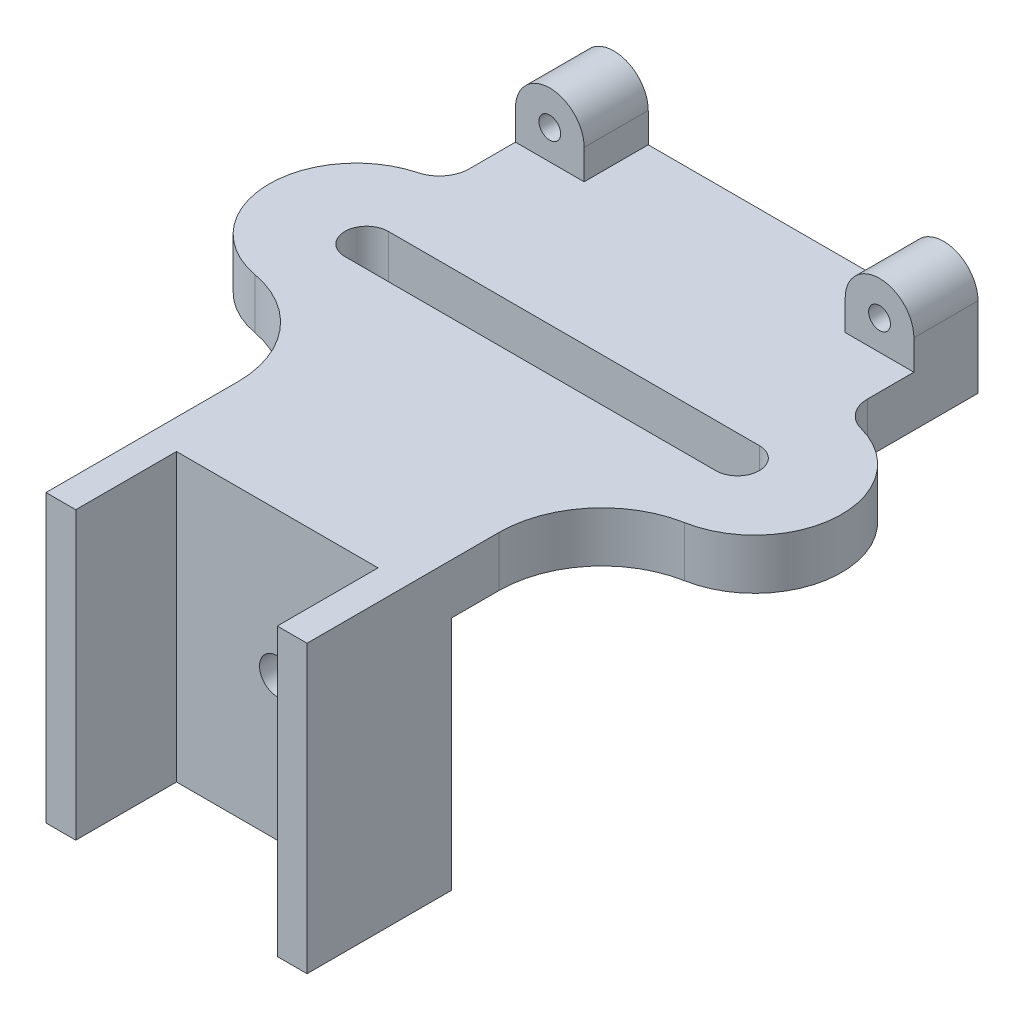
ISO-10303-21;
HEADER;
FILE_DESCRIPTION(('STEP AP214'),'2;1');
FILE_NAME('part.step','',(''),(''),'','','');
FILE_SCHEMA(('AUTOMOTIVE_DESIGN { 1 0 10303 214 1 1 1 1 }'));
ENDSEC;
DATA;
#1=APPLICATION_CONTEXT('core data for automotive mechanical design processes');
#2=APPLICATION_PROTOCOL_DEFINITION('international standard','automotive_design',2000,#1);
#3=PRODUCT_CONTEXT('',#1,'mechanical');
#4=PRODUCT('Part','Part','',(#3));
#5=PRODUCT_RELATED_PRODUCT_CATEGORY('part','',(#4));
#6=PRODUCT_DEFINITION_FORMATION('','',#4);
#7=PRODUCT_DEFINITION_CONTEXT('part definition',#1,'design');
#8=PRODUCT_DEFINITION('design','',#6,#7);
#9=PRODUCT_DEFINITION_SHAPE('','',#8);
#10=(LENGTH_UNIT() NAMED_UNIT(*) SI_UNIT(.MILLI.,.METRE.));
#11=(NAMED_UNIT(*) PLANE_ANGLE_UNIT() SI_UNIT($,.RADIAN.));
#12=(NAMED_UNIT(*) SI_UNIT($,.STERADIAN.) SOLID_ANGLE_UNIT());
#13=UNCERTAINTY_MEASURE_WITH_UNIT(LENGTH_MEASURE(1.E-05),#10,'distance_accuracy_value','');
#14=(GEOMETRIC_REPRESENTATION_CONTEXT(3) GLOBAL_UNCERTAINTY_ASSIGNED_CONTEXT((#13)) GLOBAL_UNIT_ASSIGNED_CONTEXT((#10,
#11,#12)) REPRESENTATION_CONTEXT('',''));
#15=CARTESIAN_POINT('',(0.,0.,0.));
#16=DIRECTION('',(0.,0.,1.));
#17=DIRECTION('',(1.,0.,0.));
#18=AXIS2_PLACEMENT_3D('',#15,#16,#17);
#19=CARTESIAN_POINT('',(50.8,11.176,24.5062056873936));
#20=DIRECTION('',(0.,-1.,0.));
#21=DIRECTION('',(0.,0.,-1.));
#22=AXIS2_PLACEMENT_3D('',#19,#20,#21);
#23=PLANE('',#22);
#24=CARTESIAN_POINT('',(41.148,11.176,50.292));
#25=DIRECTION('',(0.,1.,0.));
#26=DIRECTION('',(0.,0.,-1.));
#27=AXIS2_PLACEMENT_3D('',#24,#25,#26);
#28=CIRCLE('',#27,4.826);
#29=CARTESIAN_POINT('',(41.148,11.176,55.118));
#30=VERTEX_POINT('',#29);
#31=CARTESIAN_POINT('',(41.148,11.176,45.466));
#32=VERTEX_POINT('',#31);
#33=EDGE_CURVE('E360',#30,#32,#28,.T.);
#34=ORIENTED_EDGE('',*,*,#33,.F.);
#35=DIRECTION('',(1.,0.,0.));
#36=VECTOR('',#35,1.);
#37=CARTESIAN_POINT('',(0.,11.176,55.118));
#38=LINE('',#37,#36);
#39=CARTESIAN_POINT('',(-41.148,11.176,55.118));
#40=VERTEX_POINT('',#39);
#41=EDGE_CURVE('E368',#40,#30,#38,.T.);
#42=ORIENTED_EDGE('',*,*,#41,.F.);
#43=CARTESIAN_POINT('',(-41.148,11.176,50.292));
#44=DIRECTION('',(0.,1.,0.));
#45=DIRECTION('',(0.,0.,1.));
#46=AXIS2_PLACEMENT_3D('',#43,#44,#45);
#47=CIRCLE('',#46,4.826);
#48=CARTESIAN_POINT('',(-41.148,11.176,45.466));
#49=VERTEX_POINT('',#48);
#50=EDGE_CURVE('E365',#49,#40,#47,.T.);
#51=ORIENTED_EDGE('',*,*,#50,.F.);
#52=DIRECTION('',(-1.,0.,0.));
#53=VECTOR('',#52,1.);
#54=CARTESIAN_POINT('',(0.,11.176,45.466));
#55=LINE('',#54,#53);
#56=EDGE_CURVE('E362',#32,#49,#55,.T.);
#57=ORIENTED_EDGE('',*,*,#56,.F.);
#58=EDGE_LOOP('',(#34,#42,#51,#57));
#59=FACE_BOUND('',#58,.T.);
#60=DIRECTION('',(1.,0.,0.));
#61=VECTOR('',#60,1.);
#62=CARTESIAN_POINT('',(-44.196,11.176,14.224));
#63=LINE('',#62,#61);
#64=CARTESIAN_POINT('',(-44.196,11.176,14.224));
#65=VERTEX_POINT('',#64);
#66=CARTESIAN_POINT('',(-28.956,11.176,14.224));
#67=VERTEX_POINT('',#66);
#68=EDGE_CURVE('E317',#65,#67,#63,.T.);
#69=ORIENTED_EDGE('',*,*,#68,.F.);
#70=DIRECTION('',(0.,0.,1.));
#71=VECTOR('',#70,1.);
#72=CARTESIAN_POINT('',(-44.196,11.176,0.));
#73=LINE('',#72,#71);
#74=CARTESIAN_POINT('',(-44.196,11.176,24.5062056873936));
#75=VERTEX_POINT('',#74);
#76=EDGE_CURVE('E398',#65,#75,#73,.T.);
#77=ORIENTED_EDGE('',*,*,#76,.T.);
#78=CARTESIAN_POINT('',(-50.8,11.176,24.5062056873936));
#79=DIRECTION('',(0.,-1.,0.));
#80=DIRECTION('',(0.,0.,1.));
#81=AXIS2_PLACEMENT_3D('',#78,#79,#80);
#82=CIRCLE('',#81,6.604);
#83=CARTESIAN_POINT('',(-49.1166274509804,11.176,30.8920551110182));
#84=VERTEX_POINT('',#83);
#85=EDGE_CURVE('E400',#75,#84,#82,.T.);
#86=ORIENTED_EDGE('',*,*,#85,.T.);
#87=CARTESIAN_POINT('',(-44.196,11.176,49.5583841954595));
#88=DIRECTION('',(0.,1.,0.));
#89=DIRECTION('',(0.,0.,1.));
#90=AXIS2_PLACEMENT_3D('',#87,#88,#89);
#91=CIRCLE('',#90,19.304);
#92=CARTESIAN_POINT('',(-47.6846746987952,11.176,68.5445255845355));
#93=VERTEX_POINT('',#92);
#94=EDGE_CURVE('E402',#84,#93,#91,.T.);
#95=ORIENTED_EDGE('',*,*,#94,.T.);
#96=CARTESIAN_POINT('',(-51.816,11.176,91.0281140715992));
#97=DIRECTION('',(0.,-1.,0.));
#98=DIRECTION('',(0.,0.,-1.));
#99=AXIS2_PLACEMENT_3D('',#96,#97,#98);
#100=CIRCLE('',#99,22.86);
#101=CARTESIAN_POINT('',(-28.956,11.176,91.0281140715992));
#102=VERTEX_POINT('',#101);
#103=EDGE_CURVE('E404',#93,#102,#100,.T.);
#104=ORIENTED_EDGE('',*,*,#103,.T.);
#105=DIRECTION('',(0.,0.,1.));
#106=VECTOR('',#105,1.);
#107=CARTESIAN_POINT('',(-28.956,11.176,133.604));
#108=LINE('',#107,#106);
#109=CARTESIAN_POINT('',(-28.956,11.176,133.604));
#110=VERTEX_POINT('',#109);
#111=EDGE_CURVE('E406',#102,#110,#108,.T.);
#112=ORIENTED_EDGE('',*,*,#111,.T.);
#113=DIRECTION('',(1.,0.,0.));
#114=VECTOR('',#113,1.);
#115=CARTESIAN_POINT('',(-22.352,11.176,133.604));
#116=LINE('',#115,#114);
#117=CARTESIAN_POINT('',(-22.352,11.176,133.604));
#118=VERTEX_POINT('',#117);
#119=EDGE_CURVE('E408',#110,#118,#116,.T.);
#120=ORIENTED_EDGE('',*,*,#119,.T.);
#121=DIRECTION('',(0.,0.,-1.));
#122=VECTOR('',#121,1.);
#123=CARTESIAN_POINT('',(-22.352,11.176,111.252));
#124=LINE('',#123,#122);
#125=CARTESIAN_POINT('',(-22.352,11.176,111.252));
#126=VERTEX_POINT('',#125);
#127=EDGE_CURVE('E410',#118,#126,#124,.T.);
#128=ORIENTED_EDGE('',*,*,#127,.T.);
#129=DIRECTION('',(1.,0.,0.));
#130=VECTOR('',#129,1.);
#131=CARTESIAN_POINT('',(-22.352,11.176,111.252));
#132=LINE('',#131,#130);
#133=CARTESIAN_POINT('',(22.352,11.176,111.252));
#134=VERTEX_POINT('',#133);
#135=EDGE_CURVE('E412',#126,#134,#132,.T.);
#136=ORIENTED_EDGE('',*,*,#135,.T.);
#137=DIRECTION('',(0.,0.,1.));
#138=VECTOR('',#137,1.);
#139=CARTESIAN_POINT('',(22.352,11.176,111.252));
#140=LINE('',#139,#138);
#141=CARTESIAN_POINT('',(22.352,11.176,133.604));
#142=VERTEX_POINT('',#141);
#143=EDGE_CURVE('E258',#134,#142,#140,.T.);
#144=ORIENTED_EDGE('',*,*,#143,.T.);
#145=DIRECTION('',(1.,0.,0.));
#146=VECTOR('',#145,1.);
#147=CARTESIAN_POINT('',(22.352,11.176,133.604));
#148=LINE('',#147,#146);
#149=CARTESIAN_POINT('',(28.956,11.176,133.604));
#150=VERTEX_POINT('',#149);
#151=EDGE_CURVE('E415',#142,#150,#148,.T.);
#152=ORIENTED_EDGE('',*,*,#151,.T.);
#153=DIRECTION('',(0.,0.,-1.));
#154=VECTOR('',#153,1.);
#155=CARTESIAN_POINT('',(28.956,11.176,133.604));
#156=LINE('',#155,#154);
#157=CARTESIAN_POINT('',(28.956,11.176,91.0281140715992));
#158=VERTEX_POINT('',#157);
#159=EDGE_CURVE('E417',#150,#158,#156,.T.);
#160=ORIENTED_EDGE('',*,*,#159,.T.);
#161=CARTESIAN_POINT('',(51.816,11.176,91.0281140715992));
#162=DIRECTION('',(0.,-1.,0.));
#163=DIRECTION('',(0.,0.,1.));
#164=AXIS2_PLACEMENT_3D('',#161,#162,#163);
#165=CIRCLE('',#164,22.86);
#166=CARTESIAN_POINT('',(47.6846746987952,11.176,68.5445255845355));
#167=VERTEX_POINT('',#166);
#168=EDGE_CURVE('E419',#158,#167,#165,.T.);
#169=ORIENTED_EDGE('',*,*,#168,.T.);
#170=CARTESIAN_POINT('',(44.196,11.176,49.5583841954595));
#171=DIRECTION('',(0.,1.,0.));
#172=DIRECTION('',(0.,0.,-1.));
#173=AXIS2_PLACEMENT_3D('',#170,#171,#172);
#174=CIRCLE('',#173,19.304);
#175=CARTESIAN_POINT('',(49.1166274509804,11.176,30.8920551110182));
#176=VERTEX_POINT('',#175);
#177=EDGE_CURVE('E421',#167,#176,#174,.T.);
#178=ORIENTED_EDGE('',*,*,#177,.T.);
#179=CARTESIAN_POINT('',(50.8,11.176,24.5062056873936));
#180=DIRECTION('',(0.,-1.,0.));
#181=DIRECTION('',(0.,0.,-1.));
#182=AXIS2_PLACEMENT_3D('',#179,#180,#181);
#183=CIRCLE('',#182,6.604);
#184=CARTESIAN_POINT('',(44.196,11.176,24.5062056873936));
#185=VERTEX_POINT('',#184);
#186=EDGE_CURVE('E423',#176,#185,#183,.T.);
#187=ORIENTED_EDGE('',*,*,#186,.T.);
#188=DIRECTION('',(0.,0.,-1.));
#189=VECTOR('',#188,1.);
#190=CARTESIAN_POINT('',(44.196,11.176,0.));
#191=LINE('',#190,#189);
#192=CARTESIAN_POINT('',(44.196,11.176,14.224));
#193=VERTEX_POINT('',#192);
#194=EDGE_CURVE('E392',#185,#193,#191,.T.);
#195=ORIENTED_EDGE('',*,*,#194,.T.);
#196=DIRECTION('',(-1.,0.,0.));
#197=VECTOR('',#196,1.);
#198=CARTESIAN_POINT('',(44.196,11.176,14.224));
#199=LINE('',#198,#197);
#200=CARTESIAN_POINT('',(28.956,11.176,14.224));
#201=VERTEX_POINT('',#200);
#202=EDGE_CURVE('E335',#193,#201,#199,.T.);
#203=ORIENTED_EDGE('',*,*,#202,.T.);
#204=DIRECTION('',(0.,0.,-1.));
#205=VECTOR('',#204,1.);
#206=CARTESIAN_POINT('',(28.956,11.176,14.224));
#207=LINE('',#206,#205);
#208=CARTESIAN_POINT('',(28.956,11.176,0.));
#209=VERTEX_POINT('',#208);
#210=EDGE_CURVE('E347',#201,#209,#207,.T.);
#211=ORIENTED_EDGE('',*,*,#210,.T.);
#212=DIRECTION('',(-1.,0.,0.));
#213=VECTOR('',#212,1.);
#214=CARTESIAN_POINT('',(-44.196,11.176,0.));
#215=LINE('',#214,#213);
#216=CARTESIAN_POINT('',(-28.956,11.176,0.));
#217=VERTEX_POINT('',#216);
#218=EDGE_CURVE('E395',#209,#217,#215,.T.);
#219=ORIENTED_EDGE('',*,*,#218,.T.);
#220=DIRECTION('',(0.,0.,-1.));
#221=VECTOR('',#220,1.);
#222=CARTESIAN_POINT('',(-28.956,11.176,14.224));
#223=LINE('',#222,#221);
#224=EDGE_CURVE('E87',#67,#217,#223,.T.);
#225=ORIENTED_EDGE('',*,*,#224,.F.);
#226=EDGE_LOOP('',(#69,#77,#86,#95,#104,#112,#120,#128,#136,#144,#152,#160,#169,#178,#187,#195,
#203,#211,#219,#225));
#227=FACE_BOUND('',#226,.T.);
#228=ADVANCED_FACE('F63',(#59,#227),#23,.F.);
#229=CARTESIAN_POINT('',(50.8,0.,24.5062056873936));
#230=DIRECTION('',(0.,-1.,0.));
#231=DIRECTION('',(0.,0.,-1.));
#232=AXIS2_PLACEMENT_3D('',#229,#230,#231);
#233=PLANE('',#232);
#234=DIRECTION('',(1.,0.,0.));
#235=VECTOR('',#234,1.);
#236=CARTESIAN_POINT('',(-28.956,0.,101.6));
#237=LINE('',#236,#235);
#238=CARTESIAN_POINT('',(-28.956,0.,101.6));
#239=VERTEX_POINT('',#238);
#240=CARTESIAN_POINT('',(28.956,0.,101.6));
#241=VERTEX_POINT('',#240);
#242=EDGE_CURVE('E79',#239,#241,#237,.T.);
#243=ORIENTED_EDGE('',*,*,#242,.F.);
#244=DIRECTION('',(0.,0.,1.));
#245=VECTOR('',#244,1.);
#246=CARTESIAN_POINT('',(-28.956,0.,133.604));
#247=LINE('',#246,#245);
#248=CARTESIAN_POINT('',(-28.956,0.,91.0281140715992));
#249=VERTEX_POINT('',#248);
#250=EDGE_CURVE('E438',#249,#239,#247,.T.);
#251=ORIENTED_EDGE('',*,*,#250,.F.);
#252=CARTESIAN_POINT('',(-51.816,0.,91.0281140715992));
#253=DIRECTION('',(0.,-1.,0.));
#254=DIRECTION('',(0.,0.,-1.));
#255=AXIS2_PLACEMENT_3D('',#252,#253,#254);
#256=CIRCLE('',#255,22.86);
#257=CARTESIAN_POINT('',(-47.6846746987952,0.,68.5445255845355));
#258=VERTEX_POINT('',#257);
#259=EDGE_CURVE('E436',#258,#249,#256,.T.);
#260=ORIENTED_EDGE('',*,*,#259,.F.);
#261=CARTESIAN_POINT('',(-44.196,0.,49.5583841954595));
#262=DIRECTION('',(0.,1.,0.));
#263=DIRECTION('',(0.,0.,1.));
#264=AXIS2_PLACEMENT_3D('',#261,#262,#263);
#265=CIRCLE('',#264,19.304);
#266=CARTESIAN_POINT('',(-49.1166274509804,0.,30.8920551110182));
#267=VERTEX_POINT('',#266);
#268=EDGE_CURVE('E434',#267,#258,#265,.T.);
#269=ORIENTED_EDGE('',*,*,#268,.F.);
#270=CARTESIAN_POINT('',(-50.8,0.,24.5062056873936));
#271=DIRECTION('',(0.,-1.,0.));
#272=DIRECTION('',(0.,0.,1.));
#273=AXIS2_PLACEMENT_3D('',#270,#271,#272);
#274=CIRCLE('',#273,6.604);
#275=CARTESIAN_POINT('',(-44.196,0.,24.5062056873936));
#276=VERTEX_POINT('',#275);
#277=EDGE_CURVE('E432',#276,#267,#274,.T.);
#278=ORIENTED_EDGE('',*,*,#277,.F.);
#279=DIRECTION('',(0.,0.,1.));
#280=VECTOR('',#279,1.);
#281=CARTESIAN_POINT('',(-44.196,0.,0.));
#282=LINE('',#281,#280);
#283=CARTESIAN_POINT('',(-44.196,0.,0.));
#284=VERTEX_POINT('',#283);
#285=EDGE_CURVE('E430',#284,#276,#282,.T.);
#286=ORIENTED_EDGE('',*,*,#285,.F.);
#287=DIRECTION('',(-1.,0.,0.));
#288=VECTOR('',#287,1.);
#289=CARTESIAN_POINT('',(-44.196,0.,0.));
#290=LINE('',#289,#288);
#291=CARTESIAN_POINT('',(44.196,0.,0.));
#292=VERTEX_POINT('',#291);
#293=EDGE_CURVE('E428',#292,#284,#290,.T.);
#294=ORIENTED_EDGE('',*,*,#293,.F.);
#295=DIRECTION('',(0.,0.,-1.));
#296=VECTOR('',#295,1.);
#297=CARTESIAN_POINT('',(44.196,0.,0.));
#298=LINE('',#297,#296);
#299=CARTESIAN_POINT('',(44.196,0.,24.5062056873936));
#300=VERTEX_POINT('',#299);
#301=EDGE_CURVE('E391',#300,#292,#298,.T.);
#302=ORIENTED_EDGE('',*,*,#301,.F.);
#303=CARTESIAN_POINT('',(50.8,0.,24.5062056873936));
#304=DIRECTION('',(0.,-1.,0.));
#305=DIRECTION('',(0.,0.,-1.));
#306=AXIS2_PLACEMENT_3D('',#303,#304,#305);
#307=CIRCLE('',#306,6.604);
#308=CARTESIAN_POINT('',(49.1166274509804,0.,30.8920551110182));
#309=VERTEX_POINT('',#308);
#310=EDGE_CURVE('E396',#309,#300,#307,.T.);
#311=ORIENTED_EDGE('',*,*,#310,.F.);
#312=CARTESIAN_POINT('',(44.196,0.,49.5583841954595));
#313=DIRECTION('',(0.,1.,0.));
#314=DIRECTION('',(0.,0.,-1.));
#315=AXIS2_PLACEMENT_3D('',#312,#313,#314);
#316=CIRCLE('',#315,19.304);
#317=CARTESIAN_POINT('',(47.6846746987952,0.,68.5445255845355));
#318=VERTEX_POINT('',#317);
#319=EDGE_CURVE('E444',#318,#309,#316,.T.);
#320=ORIENTED_EDGE('',*,*,#319,.F.);
#321=CARTESIAN_POINT('',(51.816,0.,91.0281140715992));
#322=DIRECTION('',(0.,-1.,0.));
#323=DIRECTION('',(0.,0.,1.));
#324=AXIS2_PLACEMENT_3D('',#321,#322,#323);
#325=CIRCLE('',#324,22.86);
#326=CARTESIAN_POINT('',(28.956,0.,91.0281140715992));
#327=VERTEX_POINT('',#326);
#328=EDGE_CURVE('E442',#327,#318,#325,.T.);
#329=ORIENTED_EDGE('',*,*,#328,.F.);
#330=DIRECTION('',(0.,0.,-1.));
#331=VECTOR('',#330,1.);
#332=CARTESIAN_POINT('',(28.956,0.,133.604));
#333=LINE('',#332,#331);
#334=EDGE_CURVE('E440',#241,#327,#333,.T.);
#335=ORIENTED_EDGE('',*,*,#334,.F.);
#336=EDGE_LOOP('',(#243,#251,#260,#269,#278,#286,#294,#302,#311,#320,#329,#335));
#337=FACE_BOUND('',#336,.T.);
#338=DIRECTION('',(1.,0.,0.));
#339=VECTOR('',#338,1.);
#340=CARTESIAN_POINT('',(0.,0.,55.118));
#341=LINE('',#340,#339);
#342=CARTESIAN_POINT('',(-41.148,0.,55.118));
#343=VERTEX_POINT('',#342);
#344=CARTESIAN_POINT('',(41.148,0.,55.118));
#345=VERTEX_POINT('',#344);
#346=EDGE_CURVE('E363',#343,#345,#341,.T.);
#347=ORIENTED_EDGE('',*,*,#346,.T.);
#348=CARTESIAN_POINT('',(41.148,0.,50.292));
#349=DIRECTION('',(0.,1.,0.));
#350=DIRECTION('',(0.,0.,-1.));
#351=AXIS2_PLACEMENT_3D('',#348,#349,#350);
#352=CIRCLE('',#351,4.826);
#353=CARTESIAN_POINT('',(41.148,0.,45.466));
#354=VERTEX_POINT('',#353);
#355=EDGE_CURVE('E355',#345,#354,#352,.T.);
#356=ORIENTED_EDGE('',*,*,#355,.T.);
#357=DIRECTION('',(-1.,0.,0.));
#358=VECTOR('',#357,1.);
#359=CARTESIAN_POINT('',(0.,0.,45.466));
#360=LINE('',#359,#358);
#361=CARTESIAN_POINT('',(-41.148,0.,45.466));
#362=VERTEX_POINT('',#361);
#363=EDGE_CURVE('E373',#354,#362,#360,.T.);
#364=ORIENTED_EDGE('',*,*,#363,.T.);
#365=CARTESIAN_POINT('',(-41.148,0.,50.292));
#366=DIRECTION('',(0.,1.,0.));
#367=DIRECTION('',(0.,0.,1.));
#368=AXIS2_PLACEMENT_3D('',#365,#366,#367);
#369=CIRCLE('',#368,4.826);
#370=EDGE_CURVE('E376',#362,#343,#369,.T.);
#371=ORIENTED_EDGE('',*,*,#370,.T.);
#372=EDGE_LOOP('',(#347,#356,#364,#371));
#373=FACE_BOUND('',#372,.T.);
#374=ADVANCED_FACE('F487',(#337,#373),#233,.T.);
#375=CARTESIAN_POINT('',(44.196,11.176,0.));
#376=DIRECTION('',(-1.,0.,0.));
#377=DIRECTION('',(0.,0.,1.));
#378=AXIS2_PLACEMENT_3D('',#375,#376,#377);
#379=PLANE('',#378);
#380=ORIENTED_EDGE('',*,*,#301,.T.);
#381=DIRECTION('',(0.,-1.,0.));
#382=VECTOR('',#381,1.);
#383=CARTESIAN_POINT('',(44.196,11.176,0.));
#384=LINE('',#383,#382);
#385=CARTESIAN_POINT('',(44.196,17.78,0.));
#386=VERTEX_POINT('',#385);
#387=EDGE_CURVE('E12',#386,#292,#384,.T.);
#388=ORIENTED_EDGE('',*,*,#387,.F.);
#389=DIRECTION('',(0.,0.,-1.));
#390=VECTOR('',#389,1.);
#391=CARTESIAN_POINT('',(44.196,17.78,14.224));
#392=LINE('',#391,#390);
#393=CARTESIAN_POINT('',(44.196,17.78,14.224));
#394=VERTEX_POINT('',#393);
#395=EDGE_CURVE('E352',#394,#386,#392,.T.);
#396=ORIENTED_EDGE('',*,*,#395,.F.);
#397=DIRECTION('',(0.,-1.,0.));
#398=VECTOR('',#397,1.);
#399=CARTESIAN_POINT('',(44.196,17.78,14.224));
#400=LINE('',#399,#398);
#401=EDGE_CURVE('E344',#394,#193,#400,.T.);
#402=ORIENTED_EDGE('',*,*,#401,.T.);
#403=ORIENTED_EDGE('',*,*,#194,.F.);
#404=DIRECTION('',(0.,-1.,0.));
#405=VECTOR('',#404,1.);
#406=CARTESIAN_POINT('',(44.196,11.176,24.5062056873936));
#407=LINE('',#406,#405);
#408=EDGE_CURVE('E425',#185,#300,#407,.T.);
#409=ORIENTED_EDGE('',*,*,#408,.T.);
#410=EDGE_LOOP('',(#380,#388,#396,#402,#403,#409));
#411=FACE_BOUND('',#410,.T.);
#412=ADVANCED_FACE('F65',(#411),#379,.F.);
#413=CARTESIAN_POINT('',(-44.196,11.176,0.));
#414=DIRECTION('',(0.,0.,1.));
#415=DIRECTION('',(1.,0.,0.));
#416=AXIS2_PLACEMENT_3D('',#413,#414,#415);
#417=PLANE('',#416);
#418=ORIENTED_EDGE('',*,*,#293,.T.);
#419=DIRECTION('',(0.,-1.,0.));
#420=VECTOR('',#419,1.);
#421=CARTESIAN_POINT('',(-44.196,11.176,0.));
#422=LINE('',#421,#420);
#423=CARTESIAN_POINT('',(-44.196,17.78,0.));
#424=VERTEX_POINT('',#423);
#425=EDGE_CURVE('E72',#424,#284,#422,.T.);
#426=ORIENTED_EDGE('',*,*,#425,.F.);
#427=CARTESIAN_POINT('',(-36.576,17.78,0.));
#428=DIRECTION('',(0.,0.,-1.));
#429=DIRECTION('',(-1.,0.,0.));
#430=AXIS2_PLACEMENT_3D('',#427,#428,#429);
#431=CIRCLE('',#430,7.62000000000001);
#432=CARTESIAN_POINT('',(-28.956,17.78,0.));
#433=VERTEX_POINT('',#432);
#434=EDGE_CURVE('E310',#424,#433,#431,.T.);
#435=ORIENTED_EDGE('',*,*,#434,.T.);
#436=DIRECTION('',(0.,1.,0.));
#437=VECTOR('',#436,1.);
#438=CARTESIAN_POINT('',(-28.956,11.176,0.));
#439=LINE('',#438,#437);
#440=EDGE_CURVE('E307',#217,#433,#439,.T.);
#441=ORIENTED_EDGE('',*,*,#440,.F.);
#442=ORIENTED_EDGE('',*,*,#218,.F.);
#443=DIRECTION('',(0.,1.,0.));
#444=VECTOR('',#443,1.);
#445=CARTESIAN_POINT('',(28.956,11.176,0.));
#446=LINE('',#445,#444);
#447=CARTESIAN_POINT('',(28.956,17.78,0.));
#448=VERTEX_POINT('',#447);
#449=EDGE_CURVE('E332',#209,#448,#446,.T.);
#450=ORIENTED_EDGE('',*,*,#449,.T.);
#451=CARTESIAN_POINT('',(36.576,17.78,0.));
#452=DIRECTION('',(0.,0.,1.));
#453=DIRECTION('',(1.,0.,0.));
#454=AXIS2_PLACEMENT_3D('',#451,#452,#453);
#455=CIRCLE('',#454,7.62000000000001);
#456=EDGE_CURVE('E339',#386,#448,#455,.T.);
#457=ORIENTED_EDGE('',*,*,#456,.F.);
#458=ORIENTED_EDGE('',*,*,#387,.T.);
#459=EDGE_LOOP('',(#418,#426,#435,#441,#442,#450,#457,#458));
#460=FACE_BOUND('',#459,.T.);
#461=CARTESIAN_POINT('',(36.576,17.78,0.));
#462=DIRECTION('',(0.,0.,-1.));
#463=DIRECTION('',(-1.,0.,0.));
#464=AXIS2_PLACEMENT_3D('',#461,#462,#463);
#465=CIRCLE('',#464,2.41299999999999);
#466=CARTESIAN_POINT('',(34.163,17.78,0.));
#467=VERTEX_POINT('',#466);
#468=EDGE_CURVE('E326',#467,#467,#465,.T.);
#469=ORIENTED_EDGE('',*,*,#468,.F.);
#470=EDGE_LOOP('',(#469));
#471=FACE_BOUND('',#470,.T.);
#472=CARTESIAN_POINT('',(-36.576,17.78,0.));
#473=DIRECTION('',(0.,0.,1.));
#474=DIRECTION('',(1.,0.,0.));
#475=AXIS2_PLACEMENT_3D('',#472,#473,#474);
#476=CIRCLE('',#475,2.41299999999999);
#477=CARTESIAN_POINT('',(-34.163,17.78,0.));
#478=VERTEX_POINT('',#477);
#479=EDGE_CURVE('E323',#478,#478,#476,.T.);
#480=ORIENTED_EDGE('',*,*,#479,.T.);
#481=EDGE_LOOP('',(#480));
#482=FACE_BOUND('',#481,.T.);
#483=ADVANCED_FACE('F511',(#460,#471,#482),#417,.F.);
#484=CARTESIAN_POINT('',(-44.196,11.176,0.));
#485=DIRECTION('',(1.,0.,0.));
#486=DIRECTION('',(0.,0.,-1.));
#487=AXIS2_PLACEMENT_3D('',#484,#485,#486);
#488=PLANE('',#487);
#489=ORIENTED_EDGE('',*,*,#285,.T.);
#490=DIRECTION('',(0.,-1.,0.));
#491=VECTOR('',#490,1.);
#492=CARTESIAN_POINT('',(-44.196,11.176,24.5062056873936));
#493=LINE('',#492,#491);
#494=EDGE_CURVE('E475',#75,#276,#493,.T.);
#495=ORIENTED_EDGE('',*,*,#494,.F.);
#496=ORIENTED_EDGE('',*,*,#76,.F.);
#497=DIRECTION('',(0.,-1.,0.));
#498=VECTOR('',#497,1.);
#499=CARTESIAN_POINT('',(-44.196,17.78,14.224));
#500=LINE('',#499,#498);
#501=CARTESIAN_POINT('',(-44.196,17.78,14.224));
#502=VERTEX_POINT('',#501);
#503=EDGE_CURVE('E303',#502,#65,#500,.T.);
#504=ORIENTED_EDGE('',*,*,#503,.F.);
#505=DIRECTION('',(0.,0.,-1.));
#506=VECTOR('',#505,1.);
#507=CARTESIAN_POINT('',(-44.196,17.78,14.224));
#508=LINE('',#507,#506);
#509=EDGE_CURVE('E300',#502,#424,#508,.T.);
#510=ORIENTED_EDGE('',*,*,#509,.T.);
#511=ORIENTED_EDGE('',*,*,#425,.T.);
#512=EDGE_LOOP('',(#489,#495,#496,#504,#510,#511));
#513=FACE_BOUND('',#512,.T.);
#514=ADVANCED_FACE('F481',(#513),#488,.F.);
#515=CARTESIAN_POINT('',(-50.8,11.176,24.5062056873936));
#516=DIRECTION('',(0.,-1.,0.));
#517=DIRECTION('',(0.,0.,-1.));
#518=AXIS2_PLACEMENT_3D('',#515,#516,#517);
#519=CYLINDRICAL_SURFACE('',#518,6.604);
#520=ORIENTED_EDGE('',*,*,#277,.T.);
#521=DIRECTION('',(0.,-1.,0.));
#522=VECTOR('',#521,1.);
#523=CARTESIAN_POINT('',(-49.1166274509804,11.176,30.8920551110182));
#524=LINE('',#523,#522);
#525=EDGE_CURVE('E472',#84,#267,#524,.T.);
#526=ORIENTED_EDGE('',*,*,#525,.F.);
#527=ORIENTED_EDGE('',*,*,#85,.F.);
#528=ORIENTED_EDGE('',*,*,#494,.T.);
#529=EDGE_LOOP('',(#520,#526,#527,#528));
#530=FACE_BOUND('',#529,.T.);
#531=ADVANCED_FACE('F494',(#530),#519,.F.);
#532=CARTESIAN_POINT('',(-44.196,11.176,49.5583841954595));
#533=DIRECTION('',(0.,-1.,0.));
#534=DIRECTION('',(0.,0.,-1.));
#535=AXIS2_PLACEMENT_3D('',#532,#533,#534);
#536=CYLINDRICAL_SURFACE('',#535,19.304);
#537=ORIENTED_EDGE('',*,*,#268,.T.);
#538=DIRECTION('',(0.,-1.,0.));
#539=VECTOR('',#538,1.);
#540=CARTESIAN_POINT('',(-47.6846746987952,11.176,68.5445255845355));
#541=LINE('',#540,#539);
#542=EDGE_CURVE('E469',#93,#258,#541,.T.);
#543=ORIENTED_EDGE('',*,*,#542,.F.);
#544=ORIENTED_EDGE('',*,*,#94,.F.);
#545=ORIENTED_EDGE('',*,*,#525,.T.);
#546=EDGE_LOOP('',(#537,#543,#544,#545));
#547=FACE_BOUND('',#546,.T.);
#548=ADVANCED_FACE('F498',(#547),#536,.T.);
#549=CARTESIAN_POINT('',(-51.816,11.176,91.0281140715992));
#550=DIRECTION('',(0.,-1.,0.));
#551=DIRECTION('',(0.,0.,-1.));
#552=AXIS2_PLACEMENT_3D('',#549,#550,#551);
#553=CYLINDRICAL_SURFACE('',#552,22.86);
#554=ORIENTED_EDGE('',*,*,#259,.T.);
#555=DIRECTION('',(0.,-1.,0.));
#556=VECTOR('',#555,1.);
#557=CARTESIAN_POINT('',(-28.956,11.176,91.0281140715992));
#558=LINE('',#557,#556);
#559=EDGE_CURVE('E466',#102,#249,#558,.T.);
#560=ORIENTED_EDGE('',*,*,#559,.F.);
#561=ORIENTED_EDGE('',*,*,#103,.F.);
#562=ORIENTED_EDGE('',*,*,#542,.T.);
#563=EDGE_LOOP('',(#554,#560,#561,#562));
#564=FACE_BOUND('',#563,.T.);
#565=ADVANCED_FACE('F576',(#564),#553,.F.);
#566=CARTESIAN_POINT('',(-28.956,11.176,133.604));
#567=DIRECTION('',(1.,0.,0.));
#568=DIRECTION('',(0.,0.,-1.));
#569=AXIS2_PLACEMENT_3D('',#566,#567,#568);
#570=PLANE('',#569);
#571=ORIENTED_EDGE('',*,*,#250,.T.);
#572=DIRECTION('',(0.,1.,0.));
#573=VECTOR('',#572,1.);
#574=CARTESIAN_POINT('',(-28.956,-52.324,101.6));
#575=LINE('',#574,#573);
#576=CARTESIAN_POINT('',(-28.956,-52.324,101.6));
#577=VERTEX_POINT('',#576);
#578=EDGE_CURVE('E297',#577,#239,#575,.T.);
#579=ORIENTED_EDGE('',*,*,#578,.F.);
#580=DIRECTION('',(0.,0.,-1.));
#581=VECTOR('',#580,1.);
#582=CARTESIAN_POINT('',(-28.956,-52.324,133.604));
#583=LINE('',#582,#581);
#584=CARTESIAN_POINT('',(-28.956,-52.324,133.604));
#585=VERTEX_POINT('',#584);
#586=EDGE_CURVE('E287',#585,#577,#583,.T.);
#587=ORIENTED_EDGE('',*,*,#586,.F.);
#588=DIRECTION('',(0.,-1.,0.));
#589=VECTOR('',#588,1.);
#590=CARTESIAN_POINT('',(-28.956,11.176,133.604));
#591=LINE('',#590,#589);
#592=EDGE_CURVE('E464',#110,#585,#591,.T.);
#593=ORIENTED_EDGE('',*,*,#592,.F.);
#594=ORIENTED_EDGE('',*,*,#111,.F.);
#595=ORIENTED_EDGE('',*,*,#559,.T.);
#596=EDGE_LOOP('',(#571,#579,#587,#593,#594,#595));
#597=FACE_BOUND('',#596,.T.);
#598=ADVANCED_FACE('F572',(#597),#570,.F.);
#599=CARTESIAN_POINT('',(-22.352,11.176,133.604));
#600=DIRECTION('',(0.,0.,-1.));
#601=DIRECTION('',(-1.,0.,0.));
#602=AXIS2_PLACEMENT_3D('',#599,#600,#601);
#603=PLANE('',#602);
#604=ORIENTED_EDGE('',*,*,#592,.T.);
#605=DIRECTION('',(-1.,0.,0.));
#606=VECTOR('',#605,1.);
#607=CARTESIAN_POINT('',(-28.956,-52.324,133.604));
#608=LINE('',#607,#606);
#609=CARTESIAN_POINT('',(-22.352,-52.324,133.604));
#610=VERTEX_POINT('',#609);
#611=EDGE_CURVE('E284',#610,#585,#608,.T.);
#612=ORIENTED_EDGE('',*,*,#611,.F.);
#613=DIRECTION('',(0.,-1.,0.));
#614=VECTOR('',#613,1.);
#615=CARTESIAN_POINT('',(-22.352,11.176,133.604));
#616=LINE('',#615,#614);
#617=EDGE_CURVE('E462',#118,#610,#616,.T.);
#618=ORIENTED_EDGE('',*,*,#617,.F.);
#619=ORIENTED_EDGE('',*,*,#119,.F.);
#620=EDGE_LOOP('',(#604,#612,#618,#619));
#621=FACE_BOUND('',#620,.T.);
#622=ADVANCED_FACE('F568',(#621),#603,.F.);
#623=CARTESIAN_POINT('',(-22.352,11.176,111.252));
#624=DIRECTION('',(-1.,0.,0.));
#625=DIRECTION('',(0.,0.,1.));
#626=AXIS2_PLACEMENT_3D('',#623,#624,#625);
#627=PLANE('',#626);
#628=ORIENTED_EDGE('',*,*,#617,.T.);
#629=DIRECTION('',(0.,0.,1.));
#630=VECTOR('',#629,1.);
#631=CARTESIAN_POINT('',(-22.352,-52.324,133.604));
#632=LINE('',#631,#630);
#633=CARTESIAN_POINT('',(-22.352,-52.324,111.252));
#634=VERTEX_POINT('',#633);
#635=EDGE_CURVE('E271',#634,#610,#632,.T.);
#636=ORIENTED_EDGE('',*,*,#635,.F.);
#637=DIRECTION('',(0.,-1.,0.));
#638=VECTOR('',#637,1.);
#639=CARTESIAN_POINT('',(-22.352,11.176,111.252));
#640=LINE('',#639,#638);
#641=EDGE_CURVE('E261',#126,#634,#640,.T.);
#642=ORIENTED_EDGE('',*,*,#641,.F.);
#643=ORIENTED_EDGE('',*,*,#127,.F.);
#644=EDGE_LOOP('',(#628,#636,#642,#643));
#645=FACE_BOUND('',#644,.T.);
#646=ADVANCED_FACE('F564',(#645),#627,.F.);
#647=CARTESIAN_POINT('',(-22.352,11.176,111.252));
#648=DIRECTION('',(0.,0.,-1.));
#649=DIRECTION('',(-1.,0.,0.));
#650=AXIS2_PLACEMENT_3D('',#647,#648,#649);
#651=PLANE('',#650);
#652=CARTESIAN_POINT('',(0.,-20.828,111.252));
#653=DIRECTION('',(0.,0.,1.));
#654=DIRECTION('',(1.,0.,0.));
#655=AXIS2_PLACEMENT_3D('',#652,#653,#654);
#656=CIRCLE('',#655,3.937);
#657=CARTESIAN_POINT('',(3.937,-20.828,111.252));
#658=VERTEX_POINT('',#657);
#659=EDGE_CURVE('E281',#658,#658,#656,.T.);
#660=ORIENTED_EDGE('',*,*,#659,.F.);
#661=EDGE_LOOP('',(#660));
#662=FACE_BOUND('',#661,.T.);
#663=ORIENTED_EDGE('',*,*,#641,.T.);
#664=DIRECTION('',(-1.,0.,0.));
#665=VECTOR('',#664,1.);
#666=CARTESIAN_POINT('',(-22.352,-52.324,111.252));
#667=LINE('',#666,#665);
#668=CARTESIAN_POINT('',(22.352,-52.324,111.252));
#669=VERTEX_POINT('',#668);
#670=EDGE_CURVE('E265',#669,#634,#667,.T.);
#671=ORIENTED_EDGE('',*,*,#670,.F.);
#672=DIRECTION('',(0.,-1.,0.));
#673=VECTOR('',#672,1.);
#674=CARTESIAN_POINT('',(22.352,11.176,111.252));
#675=LINE('',#674,#673);
#676=EDGE_CURVE('E252',#134,#669,#675,.T.);
#677=ORIENTED_EDGE('',*,*,#676,.F.);
#678=ORIENTED_EDGE('',*,*,#135,.F.);
#679=EDGE_LOOP('',(#663,#671,#677,#678));
#680=FACE_BOUND('',#679,.T.);
#681=ADVANCED_FACE('F266',(#662,#680),#651,.F.);
#682=CARTESIAN_POINT('',(22.352,11.176,111.252));
#683=DIRECTION('',(1.,0.,0.));
#684=DIRECTION('',(0.,0.,-1.));
#685=AXIS2_PLACEMENT_3D('',#682,#683,#684);
#686=PLANE('',#685);
#687=ORIENTED_EDGE('',*,*,#676,.T.);
#688=DIRECTION('',(0.,0.,-1.));
#689=VECTOR('',#688,1.);
#690=CARTESIAN_POINT('',(22.352,-52.324,111.252));
#691=LINE('',#690,#689);
#692=CARTESIAN_POINT('',(22.352,-52.324,133.604));
#693=VERTEX_POINT('',#692);
#694=EDGE_CURVE('E257',#693,#669,#691,.T.);
#695=ORIENTED_EDGE('',*,*,#694,.F.);
#696=DIRECTION('',(0.,-1.,0.));
#697=VECTOR('',#696,1.);
#698=CARTESIAN_POINT('',(22.352,11.176,133.604));
#699=LINE('',#698,#697);
#700=EDGE_CURVE('E262',#142,#693,#699,.T.);
#701=ORIENTED_EDGE('',*,*,#700,.F.);
#702=ORIENTED_EDGE('',*,*,#143,.F.);
#703=EDGE_LOOP('',(#687,#695,#701,#702));
#704=FACE_BOUND('',#703,.T.);
#705=ADVANCED_FACE('F254',(#704),#686,.F.);
#706=CARTESIAN_POINT('',(22.352,11.176,133.604));
#707=DIRECTION('',(0.,0.,-1.));
#708=DIRECTION('',(-1.,0.,0.));
#709=AXIS2_PLACEMENT_3D('',#706,#707,#708);
#710=PLANE('',#709);
#711=ORIENTED_EDGE('',*,*,#700,.T.);
#712=DIRECTION('',(-1.,0.,0.));
#713=VECTOR('',#712,1.);
#714=CARTESIAN_POINT('',(22.352,-52.324,133.604));
#715=LINE('',#714,#713);
#716=CARTESIAN_POINT('',(28.956,-52.324,133.604));
#717=VERTEX_POINT('',#716);
#718=EDGE_CURVE('E277',#717,#693,#715,.T.);
#719=ORIENTED_EDGE('',*,*,#718,.F.);
#720=DIRECTION('',(0.,-1.,0.));
#721=VECTOR('',#720,1.);
#722=CARTESIAN_POINT('',(28.956,11.176,133.604));
#723=LINE('',#722,#721);
#724=EDGE_CURVE('E458',#150,#717,#723,.T.);
#725=ORIENTED_EDGE('',*,*,#724,.F.);
#726=ORIENTED_EDGE('',*,*,#151,.F.);
#727=EDGE_LOOP('',(#711,#719,#725,#726));
#728=FACE_BOUND('',#727,.T.);
#729=ADVANCED_FACE('F555',(#728),#710,.F.);
#730=CARTESIAN_POINT('',(28.956,11.176,133.604));
#731=DIRECTION('',(-1.,0.,0.));
#732=DIRECTION('',(0.,0.,1.));
#733=AXIS2_PLACEMENT_3D('',#730,#731,#732);
#734=PLANE('',#733);
#735=ORIENTED_EDGE('',*,*,#724,.T.);
#736=DIRECTION('',(0.,0.,1.));
#737=VECTOR('',#736,1.);
#738=CARTESIAN_POINT('',(28.956,-52.324,101.6));
#739=LINE('',#738,#737);
#740=CARTESIAN_POINT('',(28.956,-52.324,101.6));
#741=VERTEX_POINT('',#740);
#742=EDGE_CURVE('E291',#741,#717,#739,.T.);
#743=ORIENTED_EDGE('',*,*,#742,.F.);
#744=DIRECTION('',(0.,1.,0.));
#745=VECTOR('',#744,1.);
#746=CARTESIAN_POINT('',(28.956,-52.324,101.6));
#747=LINE('',#746,#745);
#748=EDGE_CURVE('E293',#741,#241,#747,.T.);
#749=ORIENTED_EDGE('',*,*,#748,.T.);
#750=ORIENTED_EDGE('',*,*,#334,.T.);
#751=DIRECTION('',(0.,-1.,0.));
#752=VECTOR('',#751,1.);
#753=CARTESIAN_POINT('',(28.956,11.176,91.0281140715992));
#754=LINE('',#753,#752);
#755=EDGE_CURVE('E455',#158,#327,#754,.T.);
#756=ORIENTED_EDGE('',*,*,#755,.F.);
#757=ORIENTED_EDGE('',*,*,#159,.F.);
#758=EDGE_LOOP('',(#735,#743,#749,#750,#756,#757));
#759=FACE_BOUND('',#758,.T.);
#760=ADVANCED_FACE('F551',(#759),#734,.F.);
#761=CARTESIAN_POINT('',(51.816,11.176,91.0281140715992));
#762=DIRECTION('',(0.,-1.,0.));
#763=DIRECTION('',(0.,0.,-1.));
#764=AXIS2_PLACEMENT_3D('',#761,#762,#763);
#765=CYLINDRICAL_SURFACE('',#764,22.86);
#766=ORIENTED_EDGE('',*,*,#328,.T.);
#767=DIRECTION('',(0.,-1.,0.));
#768=VECTOR('',#767,1.);
#769=CARTESIAN_POINT('',(47.6846746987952,11.176,68.5445255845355));
#770=LINE('',#769,#768);
#771=EDGE_CURVE('E452',#167,#318,#770,.T.);
#772=ORIENTED_EDGE('',*,*,#771,.F.);
#773=ORIENTED_EDGE('',*,*,#168,.F.);
#774=ORIENTED_EDGE('',*,*,#755,.T.);
#775=EDGE_LOOP('',(#766,#772,#773,#774));
#776=FACE_BOUND('',#775,.T.);
#777=ADVANCED_FACE('F547',(#776),#765,.F.);
#778=CARTESIAN_POINT('',(44.196,11.176,49.5583841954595));
#779=DIRECTION('',(0.,-1.,0.));
#780=DIRECTION('',(0.,0.,-1.));
#781=AXIS2_PLACEMENT_3D('',#778,#779,#780);
#782=CYLINDRICAL_SURFACE('',#781,19.304);
#783=ORIENTED_EDGE('',*,*,#319,.T.);
#784=DIRECTION('',(0.,-1.,0.));
#785=VECTOR('',#784,1.);
#786=CARTESIAN_POINT('',(49.1166274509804,11.176,30.8920551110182));
#787=LINE('',#786,#785);
#788=EDGE_CURVE('E449',#176,#309,#787,.T.);
#789=ORIENTED_EDGE('',*,*,#788,.F.);
#790=ORIENTED_EDGE('',*,*,#177,.F.);
#791=ORIENTED_EDGE('',*,*,#771,.T.);
#792=EDGE_LOOP('',(#783,#789,#790,#791));
#793=FACE_BOUND('',#792,.T.);
#794=ADVANCED_FACE('F543',(#793),#782,.T.);
#795=CARTESIAN_POINT('',(50.8,11.176,24.5062056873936));
#796=DIRECTION('',(0.,-1.,0.));
#797=DIRECTION('',(0.,0.,-1.));
#798=AXIS2_PLACEMENT_3D('',#795,#796,#797);
#799=CYLINDRICAL_SURFACE('',#798,6.604);
#800=ORIENTED_EDGE('',*,*,#310,.T.);
#801=ORIENTED_EDGE('',*,*,#408,.F.);
#802=ORIENTED_EDGE('',*,*,#186,.F.);
#803=ORIENTED_EDGE('',*,*,#788,.T.);
#804=EDGE_LOOP('',(#800,#801,#802,#803));
#805=FACE_BOUND('',#804,.T.);
#806=ADVANCED_FACE('F540',(#805),#799,.F.);
#807=CARTESIAN_POINT('',(41.148,11.176,50.292));
#808=DIRECTION('',(0.,-1.,0.));
#809=DIRECTION('',(0.,0.,-1.));
#810=AXIS2_PLACEMENT_3D('',#807,#808,#809);
#811=CYLINDRICAL_SURFACE('',#810,4.826);
#812=ORIENTED_EDGE('',*,*,#355,.F.);
#813=DIRECTION('',(0.,-1.,0.));
#814=VECTOR('',#813,1.);
#815=CARTESIAN_POINT('',(41.148,11.176,55.118));
#816=LINE('',#815,#814);
#817=EDGE_CURVE('E370',#30,#345,#816,.T.);
#818=ORIENTED_EDGE('',*,*,#817,.F.);
#819=ORIENTED_EDGE('',*,*,#33,.T.);
#820=DIRECTION('',(0.,-1.,0.));
#821=VECTOR('',#820,1.);
#822=CARTESIAN_POINT('',(41.148,11.176,45.466));
#823=LINE('',#822,#821);
#824=EDGE_CURVE('E388',#32,#354,#823,.T.);
#825=ORIENTED_EDGE('',*,*,#824,.T.);
#826=EDGE_LOOP('',(#812,#818,#819,#825));
#827=FACE_BOUND('',#826,.T.);
#828=ADVANCED_FACE('F537',(#827),#811,.F.);
#829=CARTESIAN_POINT('',(0.,11.176,45.466));
#830=DIRECTION('',(0.,0.,1.));
#831=DIRECTION('',(1.,0.,0.));
#832=AXIS2_PLACEMENT_3D('',#829,#830,#831);
#833=PLANE('',#832);
#834=ORIENTED_EDGE('',*,*,#363,.F.);
#835=ORIENTED_EDGE('',*,*,#824,.F.);
#836=ORIENTED_EDGE('',*,*,#56,.T.);
#837=DIRECTION('',(0.,-1.,0.));
#838=VECTOR('',#837,1.);
#839=CARTESIAN_POINT('',(-41.148,11.176,45.466));
#840=LINE('',#839,#838);
#841=EDGE_CURVE('E386',#49,#362,#840,.T.);
#842=ORIENTED_EDGE('',*,*,#841,.T.);
#843=EDGE_LOOP('',(#834,#835,#836,#842));
#844=FACE_BOUND('',#843,.T.);
#845=ADVANCED_FACE('F645',(#844),#833,.T.);
#846=CARTESIAN_POINT('',(-41.148,11.176,50.292));
#847=DIRECTION('',(0.,-1.,0.));
#848=DIRECTION('',(0.,0.,-1.));
#849=AXIS2_PLACEMENT_3D('',#846,#847,#848);
#850=CYLINDRICAL_SURFACE('',#849,4.826);
#851=ORIENTED_EDGE('',*,*,#370,.F.);
#852=ORIENTED_EDGE('',*,*,#841,.F.);
#853=ORIENTED_EDGE('',*,*,#50,.T.);
#854=DIRECTION('',(0.,-1.,0.));
#855=VECTOR('',#854,1.);
#856=CARTESIAN_POINT('',(-41.148,11.176,55.118));
#857=LINE('',#856,#855);
#858=EDGE_CURVE('E383',#40,#343,#857,.T.);
#859=ORIENTED_EDGE('',*,*,#858,.T.);
#860=EDGE_LOOP('',(#851,#852,#853,#859));
#861=FACE_BOUND('',#860,.T.);
#862=ADVANCED_FACE('F638',(#861),#850,.F.);
#863=CARTESIAN_POINT('',(0.,11.176,55.118));
#864=DIRECTION('',(0.,0.,-1.));
#865=DIRECTION('',(-1.,0.,0.));
#866=AXIS2_PLACEMENT_3D('',#863,#864,#865);
#867=PLANE('',#866);
#868=ORIENTED_EDGE('',*,*,#346,.F.);
#869=ORIENTED_EDGE('',*,*,#858,.F.);
#870=ORIENTED_EDGE('',*,*,#41,.T.);
#871=ORIENTED_EDGE('',*,*,#817,.T.);
#872=EDGE_LOOP('',(#868,#869,#870,#871));
#873=FACE_BOUND('',#872,.T.);
#874=ADVANCED_FACE('F631',(#873),#867,.T.);
#875=CARTESIAN_POINT('',(36.576,17.78,14.224));
#876=DIRECTION('',(0.,0.,-1.));
#877=DIRECTION('',(-1.,0.,0.));
#878=AXIS2_PLACEMENT_3D('',#875,#876,#877);
#879=CYLINDRICAL_SURFACE('',#878,7.62000000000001);
#880=ORIENTED_EDGE('',*,*,#456,.T.);
#881=DIRECTION('',(0.,0.,-1.));
#882=VECTOR('',#881,1.);
#883=CARTESIAN_POINT('',(28.956,17.78,14.224));
#884=LINE('',#883,#882);
#885=CARTESIAN_POINT('',(28.956,17.78,14.224));
#886=VERTEX_POINT('',#885);
#887=EDGE_CURVE('E356',#886,#448,#884,.T.);
#888=ORIENTED_EDGE('',*,*,#887,.F.);
#889=CARTESIAN_POINT('',(36.576,17.78,14.224));
#890=DIRECTION('',(0.,0.,1.));
#891=DIRECTION('',(1.,0.,0.));
#892=AXIS2_PLACEMENT_3D('',#889,#890,#891);
#893=CIRCLE('',#892,7.62000000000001);
#894=EDGE_CURVE('E342',#394,#886,#893,.T.);
#895=ORIENTED_EDGE('',*,*,#894,.F.);
#896=ORIENTED_EDGE('',*,*,#395,.T.);
#897=EDGE_LOOP('',(#880,#888,#895,#896));
#898=FACE_BOUND('',#897,.T.);
#899=ADVANCED_FACE('F629',(#898),#879,.T.);
#900=CARTESIAN_POINT('',(28.956,11.176,14.224));
#901=DIRECTION('',(-1.,0.,0.));
#902=DIRECTION('',(0.,-1.,0.));
#903=AXIS2_PLACEMENT_3D('',#900,#901,#902);
#904=PLANE('',#903);
#905=ORIENTED_EDGE('',*,*,#449,.F.);
#906=ORIENTED_EDGE('',*,*,#210,.F.);
#907=DIRECTION('',(0.,1.,0.));
#908=VECTOR('',#907,1.);
#909=CARTESIAN_POINT('',(28.956,11.176,14.224));
#910=LINE('',#909,#908);
#911=EDGE_CURVE('E338',#201,#886,#910,.T.);
#912=ORIENTED_EDGE('',*,*,#911,.T.);
#913=ORIENTED_EDGE('',*,*,#887,.T.);
#914=EDGE_LOOP('',(#905,#906,#912,#913));
#915=FACE_BOUND('',#914,.T.);
#916=ADVANCED_FACE('F626',(#915),#904,.T.);
#917=CARTESIAN_POINT('',(36.576,17.78,14.224));
#918=DIRECTION('',(0.,0.,1.));
#919=DIRECTION('',(1.,0.,0.));
#920=AXIS2_PLACEMENT_3D('',#917,#918,#919);
#921=PLANE('',#920);
#922=CARTESIAN_POINT('',(36.576,17.78,14.224));
#923=DIRECTION('',(0.,0.,-1.));
#924=DIRECTION('',(-1.,0.,0.));
#925=AXIS2_PLACEMENT_3D('',#922,#923,#924);
#926=CIRCLE('',#925,2.41299999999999);
#927=CARTESIAN_POINT('',(34.163,17.78,14.224));
#928=VERTEX_POINT('',#927);
#929=EDGE_CURVE('E329',#928,#928,#926,.T.);
#930=ORIENTED_EDGE('',*,*,#929,.T.);
#931=EDGE_LOOP('',(#930));
#932=FACE_BOUND('',#931,.T.);
#933=ORIENTED_EDGE('',*,*,#202,.F.);
#934=ORIENTED_EDGE('',*,*,#401,.F.);
#935=ORIENTED_EDGE('',*,*,#894,.T.);
#936=ORIENTED_EDGE('',*,*,#911,.F.);
#937=EDGE_LOOP('',(#933,#934,#935,#936));
#938=FACE_BOUND('',#937,.T.);
#939=ADVANCED_FACE('F622',(#932,#938),#921,.T.);
#940=CARTESIAN_POINT('',(36.576,17.78,14.224));
#941=DIRECTION('',(0.,0.,-1.));
#942=DIRECTION('',(-1.,0.,0.));
#943=AXIS2_PLACEMENT_3D('',#940,#941,#942);
#944=CYLINDRICAL_SURFACE('',#943,2.41299999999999);
#945=ORIENTED_EDGE('',*,*,#929,.F.);
#946=EDGE_LOOP('',(#945));
#947=FACE_BOUND('',#946,.T.);
#948=ORIENTED_EDGE('',*,*,#468,.T.);
#949=EDGE_LOOP('',(#948));
#950=FACE_BOUND('',#949,.T.);
#951=ADVANCED_FACE('F743',(#947,#950),#944,.F.);
#952=CARTESIAN_POINT('',(-36.576,17.78,14.224));
#953=DIRECTION('',(0.,0.,-1.));
#954=DIRECTION('',(-1.,0.,0.));
#955=AXIS2_PLACEMENT_3D('',#952,#953,#954);
#956=PLANE('',#955);
#957=CARTESIAN_POINT('',(-36.576,17.78,14.224));
#958=DIRECTION('',(0.,0.,-1.));
#959=DIRECTION('',(-1.,0.,0.));
#960=AXIS2_PLACEMENT_3D('',#957,#958,#959);
#961=CIRCLE('',#960,7.62000000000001);
#962=CARTESIAN_POINT('',(-28.956,17.78,14.224));
#963=VERTEX_POINT('',#962);
#964=EDGE_CURVE('E311',#502,#963,#961,.T.);
#965=ORIENTED_EDGE('',*,*,#964,.F.);
#966=ORIENTED_EDGE('',*,*,#503,.T.);
#967=ORIENTED_EDGE('',*,*,#68,.T.);
#968=DIRECTION('',(0.,1.,0.));
#969=VECTOR('',#968,1.);
#970=CARTESIAN_POINT('',(-28.956,11.176,14.224));
#971=LINE('',#970,#969);
#972=EDGE_CURVE('E319',#67,#963,#971,.T.);
#973=ORIENTED_EDGE('',*,*,#972,.T.);
#974=EDGE_LOOP('',(#965,#966,#967,#973));
#975=FACE_BOUND('',#974,.T.);
#976=CARTESIAN_POINT('',(-36.576,17.78,14.224));
#977=DIRECTION('',(0.,0.,1.));
#978=DIRECTION('',(1.,0.,0.));
#979=AXIS2_PLACEMENT_3D('',#976,#977,#978);
#980=CIRCLE('',#979,2.41299999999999);
#981=CARTESIAN_POINT('',(-34.163,17.78,14.224));
#982=VERTEX_POINT('',#981);
#983=EDGE_CURVE('E314',#982,#982,#980,.T.);
#984=ORIENTED_EDGE('',*,*,#983,.F.);
#985=EDGE_LOOP('',(#984));
#986=FACE_BOUND('',#985,.T.);
#987=ADVANCED_FACE('F504',(#975,#986),#956,.F.);
#988=CARTESIAN_POINT('',(-36.576,17.78,14.224));
#989=DIRECTION('',(0.,0.,-1.));
#990=DIRECTION('',(-1.,0.,0.));
#991=AXIS2_PLACEMENT_3D('',#988,#989,#990);
#992=CYLINDRICAL_SURFACE('',#991,7.62000000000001);
#993=ORIENTED_EDGE('',*,*,#434,.F.);
#994=ORIENTED_EDGE('',*,*,#509,.F.);
#995=ORIENTED_EDGE('',*,*,#964,.T.);
#996=DIRECTION('',(0.,0.,-1.));
#997=VECTOR('',#996,1.);
#998=CARTESIAN_POINT('',(-28.956,17.78,14.224));
#999=LINE('',#998,#997);
#1000=EDGE_CURVE('E301',#963,#433,#999,.T.);
#1001=ORIENTED_EDGE('',*,*,#1000,.T.);
#1002=EDGE_LOOP('',(#993,#994,#995,#1001));
#1003=FACE_BOUND('',#1002,.T.);
#1004=ADVANCED_FACE('F509',(#1003),#992,.T.);
#1005=CARTESIAN_POINT('',(-28.956,11.176,14.224));
#1006=DIRECTION('',(-1.,0.,0.));
#1007=DIRECTION('',(0.,-1.,0.));
#1008=AXIS2_PLACEMENT_3D('',#1005,#1006,#1007);
#1009=PLANE('',#1008);
#1010=ORIENTED_EDGE('',*,*,#440,.T.);
#1011=ORIENTED_EDGE('',*,*,#1000,.F.);
#1012=ORIENTED_EDGE('',*,*,#972,.F.);
#1013=ORIENTED_EDGE('',*,*,#224,.T.);
#1014=EDGE_LOOP('',(#1010,#1011,#1012,#1013));
#1015=FACE_BOUND('',#1014,.T.);
#1016=ADVANCED_FACE('F515',(#1015),#1009,.F.);
#1017=CARTESIAN_POINT('',(-36.576,17.78,14.224));
#1018=DIRECTION('',(0.,0.,-1.));
#1019=DIRECTION('',(-1.,0.,0.));
#1020=AXIS2_PLACEMENT_3D('',#1017,#1018,#1019);
#1021=CYLINDRICAL_SURFACE('',#1020,2.41299999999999);
#1022=ORIENTED_EDGE('',*,*,#983,.T.);
#1023=EDGE_LOOP('',(#1022));
#1024=FACE_BOUND('',#1023,.T.);
#1025=ORIENTED_EDGE('',*,*,#479,.F.);
#1026=EDGE_LOOP('',(#1025));
#1027=FACE_BOUND('',#1026,.T.);
#1028=ADVANCED_FACE('F517',(#1024,#1027),#1021,.F.);
#1029=CARTESIAN_POINT('',(-28.956,-52.324,101.6));
#1030=DIRECTION('',(0.,0.,1.));
#1031=DIRECTION('',(1.,0.,0.));
#1032=AXIS2_PLACEMENT_3D('',#1029,#1030,#1031);
#1033=PLANE('',#1032);
#1034=CARTESIAN_POINT('',(0.,-20.828,101.6));
#1035=DIRECTION('',(0.,0.,1.));
#1036=DIRECTION('',(1.,0.,0.));
#1037=AXIS2_PLACEMENT_3D('',#1034,#1035,#1036);
#1038=CIRCLE('',#1037,3.937);
#1039=CARTESIAN_POINT('',(3.937,-20.828,101.6));
#1040=VERTEX_POINT('',#1039);
#1041=EDGE_CURVE('E67',#1040,#1040,#1038,.T.);
#1042=ORIENTED_EDGE('',*,*,#1041,.T.);
#1043=EDGE_LOOP('',(#1042));
#1044=FACE_BOUND('',#1043,.T.);
#1045=ORIENTED_EDGE('',*,*,#242,.T.);
#1046=ORIENTED_EDGE('',*,*,#748,.F.);
#1047=DIRECTION('',(1.,0.,0.));
#1048=VECTOR('',#1047,1.);
#1049=CARTESIAN_POINT('',(-28.956,-52.324,101.6));
#1050=LINE('',#1049,#1048);
#1051=EDGE_CURVE('E289',#577,#741,#1050,.T.);
#1052=ORIENTED_EDGE('',*,*,#1051,.F.);
#1053=ORIENTED_EDGE('',*,*,#578,.T.);
#1054=EDGE_LOOP('',(#1045,#1046,#1052,#1053));
#1055=FACE_BOUND('',#1054,.T.);
#1056=ADVANCED_FACE('F523',(#1044,#1055),#1033,.F.);
#1057=CARTESIAN_POINT('',(0.,-52.324,0.));
#1058=DIRECTION('',(0.,1.,0.));
#1059=DIRECTION('',(0.,0.,1.));
#1060=AXIS2_PLACEMENT_3D('',#1057,#1058,#1059);
#1061=PLANE('',#1060);
#1062=ORIENTED_EDGE('',*,*,#694,.T.);
#1063=ORIENTED_EDGE('',*,*,#670,.T.);
#1064=ORIENTED_EDGE('',*,*,#635,.T.);
#1065=ORIENTED_EDGE('',*,*,#611,.T.);
#1066=ORIENTED_EDGE('',*,*,#586,.T.);
#1067=ORIENTED_EDGE('',*,*,#1051,.T.);
#1068=ORIENTED_EDGE('',*,*,#742,.T.);
#1069=ORIENTED_EDGE('',*,*,#718,.T.);
#1070=EDGE_LOOP('',(#1062,#1063,#1064,#1065,#1066,#1067,#1068,#1069));
#1071=FACE_BOUND('',#1070,.T.);
#1072=ADVANCED_FACE('F274',(#1071),#1061,.F.);
#1073=CARTESIAN_POINT('',(0.,-20.828,47.752));
#1074=DIRECTION('',(0.,0.,1.));
#1075=DIRECTION('',(1.,0.,0.));
#1076=AXIS2_PLACEMENT_3D('',#1073,#1074,#1075);
#1077=CYLINDRICAL_SURFACE('',#1076,3.937);
#1078=ORIENTED_EDGE('',*,*,#659,.T.);
#1079=EDGE_LOOP('',(#1078));
#1080=FACE_BOUND('',#1079,.T.);
#1081=ORIENTED_EDGE('',*,*,#1041,.F.);
#1082=EDGE_LOOP('',(#1081));
#1083=FACE_BOUND('',#1082,.T.);
#1084=ADVANCED_FACE('F886',(#1080,#1083),#1077,.F.);
#1085=CLOSED_SHELL('',(#228,#374,#412,#483,#514,#531,#548,#565,#598,#622,#646,#681,#705,#729,
#760,#777,#794,#806,#828,#845,#862,#874,#899,#916,#939,#951,#987,#1004,#1016,#1028,#1056,#1072,#1084));
#1086=MANIFOLD_SOLID_BREP('B2',#1085);
#1087=ADVANCED_BREP_SHAPE_REPRESENTATION('',(#18,#1086),#14);
#1088=SHAPE_DEFINITION_REPRESENTATION(#9,#1087);
ENDSEC;
END-ISO-10303-21;
